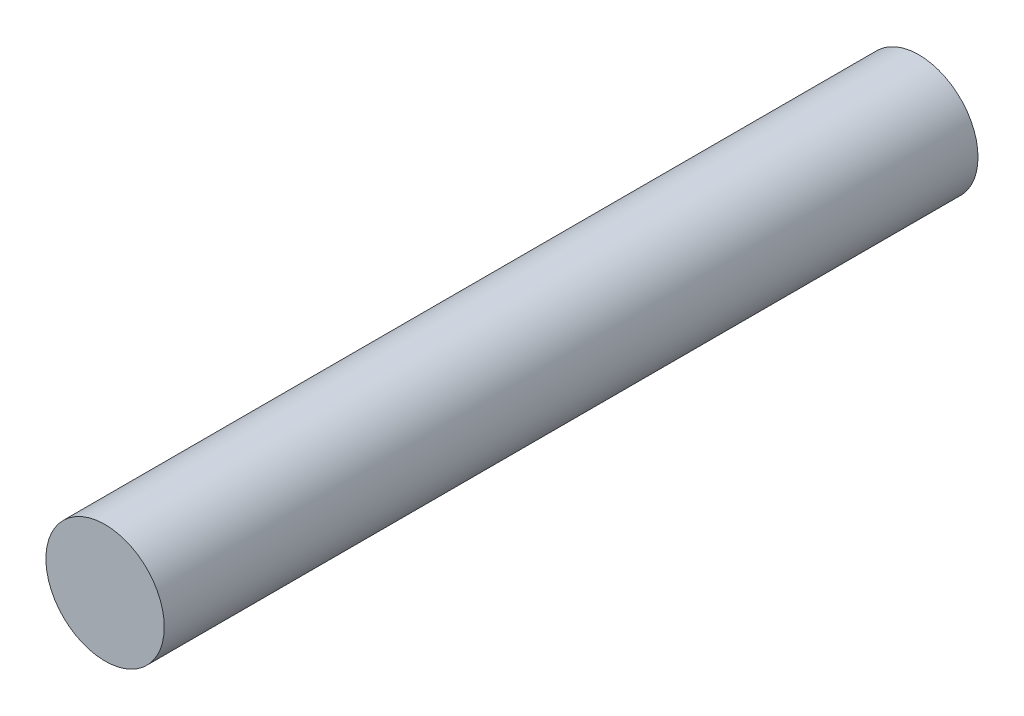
ISO-10303-21;
HEADER;
FILE_DESCRIPTION(('STEP AP214'),'2;1');
FILE_NAME('part.step','',(''),(''),'','','');
FILE_SCHEMA(('AUTOMOTIVE_DESIGN { 1 0 10303 214 1 1 1 1 }'));
ENDSEC;
DATA;
#1=APPLICATION_CONTEXT('core data for automotive mechanical design processes');
#2=APPLICATION_PROTOCOL_DEFINITION('international standard','automotive_design',2000,#1);
#3=PRODUCT_CONTEXT('',#1,'mechanical');
#4=PRODUCT('Part','Part','',(#3));
#5=PRODUCT_RELATED_PRODUCT_CATEGORY('part','',(#4));
#6=PRODUCT_DEFINITION_FORMATION('','',#4);
#7=PRODUCT_DEFINITION_CONTEXT('part definition',#1,'design');
#8=PRODUCT_DEFINITION('design','',#6,#7);
#9=PRODUCT_DEFINITION_SHAPE('','',#8);
#10=(LENGTH_UNIT() NAMED_UNIT(*) SI_UNIT(.MILLI.,.METRE.));
#11=(NAMED_UNIT(*) PLANE_ANGLE_UNIT() SI_UNIT($,.RADIAN.));
#12=(NAMED_UNIT(*) SI_UNIT($,.STERADIAN.) SOLID_ANGLE_UNIT());
#13=UNCERTAINTY_MEASURE_WITH_UNIT(LENGTH_MEASURE(1.E-05),#10,'distance_accuracy_value','');
#14=(GEOMETRIC_REPRESENTATION_CONTEXT(3) GLOBAL_UNCERTAINTY_ASSIGNED_CONTEXT((#13)) GLOBAL_UNIT_ASSIGNED_CONTEXT((#10,
#11,#12)) REPRESENTATION_CONTEXT('',''));
#15=CARTESIAN_POINT('',(0.,0.,0.));
#16=DIRECTION('',(0.,0.,1.));
#17=DIRECTION('',(1.,0.,0.));
#18=AXIS2_PLACEMENT_3D('',#15,#16,#17);
#19=CARTESIAN_POINT('',(0.,0.,55.));
#20=DIRECTION('',(0.,0.,-1.));
#21=DIRECTION('',(-1.,0.,0.));
#22=AXIS2_PLACEMENT_3D('',#19,#20,#21);
#23=CYLINDRICAL_SURFACE('',#22,4.);
#24=CARTESIAN_POINT('',(0.,0.,55.));
#25=DIRECTION('',(0.,0.,1.));
#26=DIRECTION('',(1.,0.,0.));
#27=AXIS2_PLACEMENT_3D('',#24,#25,#26);
#28=CIRCLE('',#27,4.);
#29=CARTESIAN_POINT('',(4.,0.,55.));
#30=VERTEX_POINT('',#29);
#31=EDGE_CURVE('E8',#30,#30,#28,.T.);
#32=ORIENTED_EDGE('',*,*,#31,.F.);
#33=EDGE_LOOP('',(#32));
#34=FACE_BOUND('',#33,.T.);
#35=CARTESIAN_POINT('',(0.,0.,0.));
#36=DIRECTION('',(0.,0.,1.));
#37=DIRECTION('',(1.,0.,0.));
#38=AXIS2_PLACEMENT_3D('',#35,#36,#37);
#39=CIRCLE('',#38,4.);
#40=CARTESIAN_POINT('',(4.,0.,0.));
#41=VERTEX_POINT('',#40);
#42=EDGE_CURVE('E15',#41,#41,#39,.T.);
#43=ORIENTED_EDGE('',*,*,#42,.T.);
#44=EDGE_LOOP('',(#43));
#45=FACE_BOUND('',#44,.T.);
#46=ADVANCED_FACE('F12',(#34,#45),#23,.T.);
#47=CARTESIAN_POINT('',(0.,0.,55.));
#48=DIRECTION('',(0.,0.,1.));
#49=DIRECTION('',(1.,0.,0.));
#50=AXIS2_PLACEMENT_3D('',#47,#48,#49);
#51=PLANE('',#50);
#52=ORIENTED_EDGE('',*,*,#31,.T.);
#53=EDGE_LOOP('',(#52));
#54=FACE_BOUND('',#53,.T.);
#55=ADVANCED_FACE('F27',(#54),#51,.T.);
#56=CARTESIAN_POINT('',(0.,0.,0.));
#57=DIRECTION('',(0.,0.,1.));
#58=DIRECTION('',(1.,0.,0.));
#59=AXIS2_PLACEMENT_3D('',#56,#57,#58);
#60=PLANE('',#59);
#61=ORIENTED_EDGE('',*,*,#42,.F.);
#62=EDGE_LOOP('',(#61));
#63=FACE_BOUND('',#62,.T.);
#64=ADVANCED_FACE('F25',(#63),#60,.F.);
#65=CLOSED_SHELL('',(#46,#55,#64));
#66=MANIFOLD_SOLID_BREP('B1',#65);
#67=ADVANCED_BREP_SHAPE_REPRESENTATION('',(#18,#66),#14);
#68=SHAPE_DEFINITION_REPRESENTATION(#9,#67);
ENDSEC;
END-ISO-10303-21;
